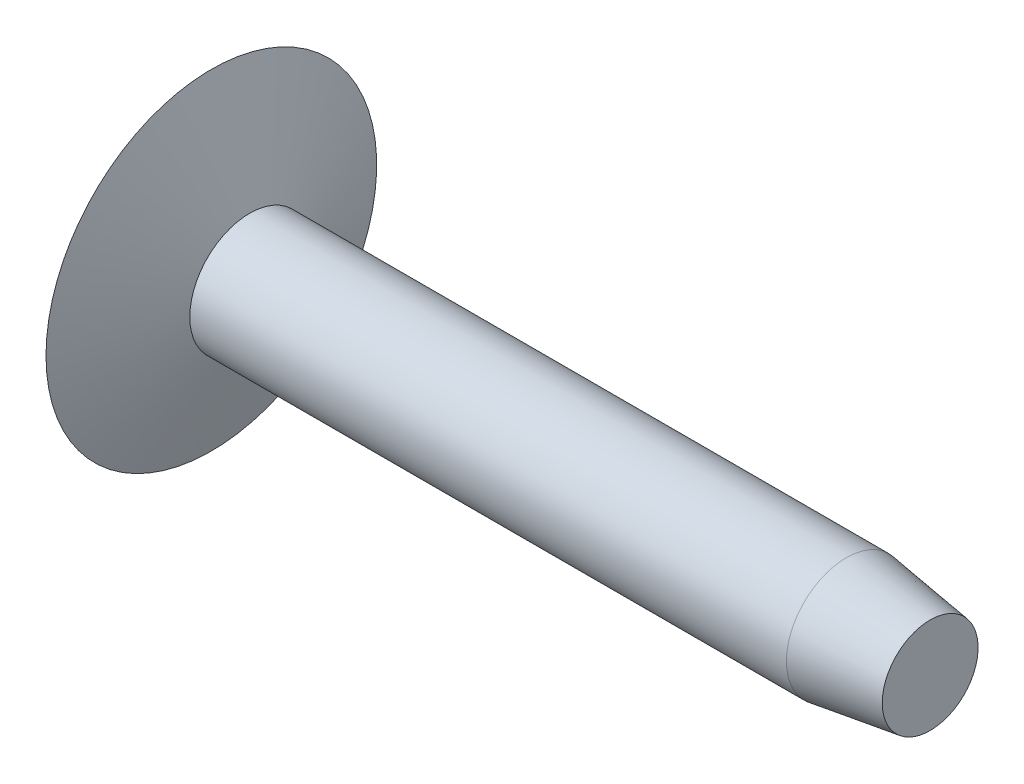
from build123d import *


with BuildPart() as part:
    # Sketch1 → Base-Revolve (revolve)
    with BuildSketch(Plane.XY, mode=Mode.PRIVATE) as base_revolve_sk:
        Polygon((0, 0), (0, 6.9), (1.601469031, 2.5), (26.5, 2.5), (30, 2), (30, 0), align=None)
    revolve(base_revolve_sk.sketch.rotate(Axis((0, 0, 0), (1, 0, 0)), 90), axis=Axis((0, 0, 0), (1, 0, 0)))


solid = part.part
